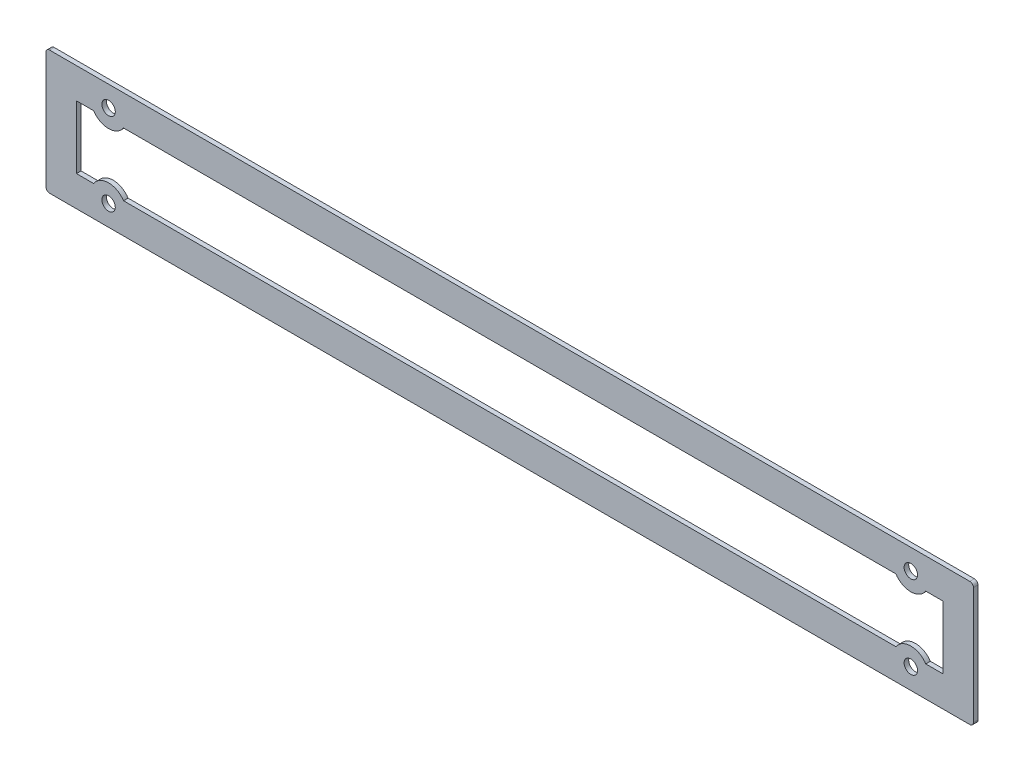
ISO-10303-21;
HEADER;
FILE_DESCRIPTION(('STEP AP214'),'2;1');
FILE_NAME('part.step','',(''),(''),'','','');
FILE_SCHEMA(('AUTOMOTIVE_DESIGN { 1 0 10303 214 1 1 1 1 }'));
ENDSEC;
DATA;
#1=APPLICATION_CONTEXT('core data for automotive mechanical design processes');
#2=APPLICATION_PROTOCOL_DEFINITION('international standard','automotive_design',2000,#1);
#3=PRODUCT_CONTEXT('',#1,'mechanical');
#4=PRODUCT('Part','Part','',(#3));
#5=PRODUCT_RELATED_PRODUCT_CATEGORY('part','',(#4));
#6=PRODUCT_DEFINITION_FORMATION('','',#4);
#7=PRODUCT_DEFINITION_CONTEXT('part definition',#1,'design');
#8=PRODUCT_DEFINITION('design','',#6,#7);
#9=PRODUCT_DEFINITION_SHAPE('','',#8);
#10=(LENGTH_UNIT() NAMED_UNIT(*) SI_UNIT(.MILLI.,.METRE.));
#11=(NAMED_UNIT(*) PLANE_ANGLE_UNIT() SI_UNIT($,.RADIAN.));
#12=(NAMED_UNIT(*) SI_UNIT($,.STERADIAN.) SOLID_ANGLE_UNIT());
#13=UNCERTAINTY_MEASURE_WITH_UNIT(LENGTH_MEASURE(1.E-05),#10,'distance_accuracy_value','');
#14=(GEOMETRIC_REPRESENTATION_CONTEXT(3) GLOBAL_UNCERTAINTY_ASSIGNED_CONTEXT((#13)) GLOBAL_UNIT_ASSIGNED_CONTEXT((#10,
#11,#12)) REPRESENTATION_CONTEXT('',''));
#15=CARTESIAN_POINT('',(0.,0.,0.));
#16=DIRECTION('',(0.,0.,1.));
#17=DIRECTION('',(1.,0.,0.));
#18=AXIS2_PLACEMENT_3D('',#15,#16,#17);
#19=CARTESIAN_POINT('',(883.209871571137,555.94395895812,0.));
#20=DIRECTION('',(0.,0.,-1.));
#21=DIRECTION('',(-1.,0.,0.));
#22=AXIS2_PLACEMENT_3D('',#19,#20,#21);
#23=CYLINDRICAL_SURFACE('',#22,2.9718);
#24=CARTESIAN_POINT('',(883.209871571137,555.94395895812,2.032));
#25=DIRECTION('',(0.,0.,1.));
#26=DIRECTION('',(-1.,0.,0.));
#27=AXIS2_PLACEMENT_3D('',#24,#25,#26);
#28=CIRCLE('',#27,2.9718);
#29=CARTESIAN_POINT('',(886.181671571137,555.94395895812,2.032));
#30=VERTEX_POINT('',#29);
#31=EDGE_CURVE('E11',#30,#30,#28,.T.);
#32=ORIENTED_EDGE('',*,*,#31,.T.);
#33=EDGE_LOOP('',(#32));
#34=FACE_BOUND('',#33,.T.);
#35=CARTESIAN_POINT('',(883.209871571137,555.94395895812,0.));
#36=DIRECTION('',(0.,0.,-1.));
#37=DIRECTION('',(-1.,0.,0.));
#38=AXIS2_PLACEMENT_3D('',#35,#36,#37);
#39=CIRCLE('',#38,2.9718);
#40=CARTESIAN_POINT('',(886.181671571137,555.94395895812,0.));
#41=VERTEX_POINT('',#40);
#42=EDGE_CURVE('E27',#41,#41,#39,.T.);
#43=ORIENTED_EDGE('',*,*,#42,.T.);
#44=EDGE_LOOP('',(#43));
#45=FACE_BOUND('',#44,.T.);
#46=ADVANCED_FACE('F16',(#34,#45),#23,.F.);
#47=CARTESIAN_POINT('',(883.209871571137,519.26635895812,0.));
#48=DIRECTION('',(0.,0.,-1.));
#49=DIRECTION('',(-1.,0.,0.));
#50=AXIS2_PLACEMENT_3D('',#47,#48,#49);
#51=CYLINDRICAL_SURFACE('',#50,2.9718);
#52=CARTESIAN_POINT('',(883.209871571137,519.26635895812,2.032));
#53=DIRECTION('',(0.,0.,1.));
#54=DIRECTION('',(-1.,0.,0.));
#55=AXIS2_PLACEMENT_3D('',#52,#53,#54);
#56=CIRCLE('',#55,2.9718);
#57=CARTESIAN_POINT('',(886.181671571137,519.26635895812,2.032));
#58=VERTEX_POINT('',#57);
#59=EDGE_CURVE('E291',#58,#58,#56,.T.);
#60=ORIENTED_EDGE('',*,*,#59,.T.);
#61=EDGE_LOOP('',(#60));
#62=FACE_BOUND('',#61,.T.);
#63=CARTESIAN_POINT('',(883.209871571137,519.26635895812,0.));
#64=DIRECTION('',(0.,0.,-1.));
#65=DIRECTION('',(-1.,0.,0.));
#66=AXIS2_PLACEMENT_3D('',#63,#64,#65);
#67=CIRCLE('',#66,2.9718);
#68=CARTESIAN_POINT('',(886.181671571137,519.26635895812,0.));
#69=VERTEX_POINT('',#68);
#70=EDGE_CURVE('E287',#69,#69,#67,.T.);
#71=ORIENTED_EDGE('',*,*,#70,.T.);
#72=EDGE_LOOP('',(#71));
#73=FACE_BOUND('',#72,.T.);
#74=ADVANCED_FACE('F521',(#62,#73),#51,.F.);
#75=CARTESIAN_POINT('',(1238.80987157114,555.94395895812,0.));
#76=DIRECTION('',(0.,0.,-1.));
#77=DIRECTION('',(-1.,0.,0.));
#78=AXIS2_PLACEMENT_3D('',#75,#76,#77);
#79=CYLINDRICAL_SURFACE('',#78,2.97180000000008);
#80=CARTESIAN_POINT('',(1238.80987157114,555.94395895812,2.032));
#81=DIRECTION('',(0.,0.,1.));
#82=DIRECTION('',(-1.,0.,0.));
#83=AXIS2_PLACEMENT_3D('',#80,#81,#82);
#84=CIRCLE('',#83,2.97180000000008);
#85=CARTESIAN_POINT('',(1241.78167157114,555.94395895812,2.032));
#86=VERTEX_POINT('',#85);
#87=EDGE_CURVE('E227',#86,#86,#84,.T.);
#88=ORIENTED_EDGE('',*,*,#87,.T.);
#89=EDGE_LOOP('',(#88));
#90=FACE_BOUND('',#89,.T.);
#91=CARTESIAN_POINT('',(1238.80987157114,555.94395895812,0.));
#92=DIRECTION('',(0.,0.,-1.));
#93=DIRECTION('',(-1.,0.,0.));
#94=AXIS2_PLACEMENT_3D('',#91,#92,#93);
#95=CIRCLE('',#94,2.97180000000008);
#96=CARTESIAN_POINT('',(1241.78167157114,555.94395895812,0.));
#97=VERTEX_POINT('',#96);
#98=EDGE_CURVE('E221',#97,#97,#95,.T.);
#99=ORIENTED_EDGE('',*,*,#98,.T.);
#100=EDGE_LOOP('',(#99));
#101=FACE_BOUND('',#100,.T.);
#102=ADVANCED_FACE('F517',(#90,#101),#79,.F.);
#103=CARTESIAN_POINT('',(1238.80987157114,519.26635895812,0.));
#104=DIRECTION('',(0.,0.,-1.));
#105=DIRECTION('',(-1.,0.,0.));
#106=AXIS2_PLACEMENT_3D('',#103,#104,#105);
#107=CYLINDRICAL_SURFACE('',#106,2.97180000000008);
#108=CARTESIAN_POINT('',(1238.80987157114,519.26635895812,2.032));
#109=DIRECTION('',(0.,0.,1.));
#110=DIRECTION('',(-1.,0.,0.));
#111=AXIS2_PLACEMENT_3D('',#108,#109,#110);
#112=CIRCLE('',#111,2.97180000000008);
#113=CARTESIAN_POINT('',(1241.78167157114,519.26635895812,2.032));
#114=VERTEX_POINT('',#113);
#115=EDGE_CURVE('E216',#114,#114,#112,.T.);
#116=ORIENTED_EDGE('',*,*,#115,.T.);
#117=EDGE_LOOP('',(#116));
#118=FACE_BOUND('',#117,.T.);
#119=CARTESIAN_POINT('',(1238.80987157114,519.26635895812,0.));
#120=DIRECTION('',(0.,0.,-1.));
#121=DIRECTION('',(-1.,0.,0.));
#122=AXIS2_PLACEMENT_3D('',#119,#120,#121);
#123=CIRCLE('',#122,2.97180000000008);
#124=CARTESIAN_POINT('',(1241.78167157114,519.26635895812,0.));
#125=VERTEX_POINT('',#124);
#126=EDGE_CURVE('E222',#125,#125,#123,.T.);
#127=ORIENTED_EDGE('',*,*,#126,.T.);
#128=EDGE_LOOP('',(#127));
#129=FACE_BOUND('',#128,.T.);
#130=ADVANCED_FACE('F509',(#118,#129),#107,.F.);
#131=CARTESIAN_POINT('',(1061.00987157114,523.63515895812,0.));
#132=DIRECTION('',(0.,1.,0.));
#133=DIRECTION('',(-1.,0.,0.));
#134=AXIS2_PLACEMENT_3D('',#131,#132,#133);
#135=PLANE('',#134);
#136=DIRECTION('',(1.,0.,0.));
#137=VECTOR('',#136,1.);
#138=CARTESIAN_POINT('',(1232.18284412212,523.63515895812,2.032));
#139=LINE('',#138,#137);
#140=CARTESIAN_POINT('',(889.836899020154,523.63515895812,2.032));
#141=VERTEX_POINT('',#140);
#142=CARTESIAN_POINT('',(1232.18284412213,523.635158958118,2.032));
#143=VERTEX_POINT('',#142);
#144=EDGE_CURVE('E230',#141,#143,#139,.T.);
#145=ORIENTED_EDGE('',*,*,#144,.T.);
#146=DIRECTION('',(0.,0.,1.));
#147=VECTOR('',#146,1.);
#148=CARTESIAN_POINT('',(1232.18284412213,523.635158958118,0.));
#149=LINE('',#148,#147);
#150=CARTESIAN_POINT('',(1232.18284412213,523.635158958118,0.));
#151=VERTEX_POINT('',#150);
#152=EDGE_CURVE('E309',#151,#143,#149,.T.);
#153=ORIENTED_EDGE('',*,*,#152,.F.);
#154=DIRECTION('',(-1.,0.,0.));
#155=VECTOR('',#154,1.);
#156=CARTESIAN_POINT('',(1232.18284412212,523.63515895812,0.));
#157=LINE('',#156,#155);
#158=CARTESIAN_POINT('',(889.836899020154,523.63515895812,0.));
#159=VERTEX_POINT('',#158);
#160=EDGE_CURVE('E255',#151,#159,#157,.T.);
#161=ORIENTED_EDGE('',*,*,#160,.T.);
#162=DIRECTION('',(0.,0.,1.));
#163=VECTOR('',#162,1.);
#164=CARTESIAN_POINT('',(889.836899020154,523.63515895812,0.));
#165=LINE('',#164,#163);
#166=EDGE_CURVE('E253',#159,#141,#165,.T.);
#167=ORIENTED_EDGE('',*,*,#166,.T.);
#168=EDGE_LOOP('',(#145,#153,#161,#167));
#169=FACE_BOUND('',#168,.T.);
#170=ADVANCED_FACE('F507',(#169),#135,.T.);
#171=CARTESIAN_POINT('',(1238.80987157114,519.266358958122,0.));
#172=DIRECTION('',(0.,0.,-1.));
#173=DIRECTION('',(1.,0.,0.));
#174=AXIS2_PLACEMENT_3D('',#171,#172,#173);
#175=CYLINDRICAL_SURFACE('',#174,7.93750000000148);
#176=CARTESIAN_POINT('',(1238.80987157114,519.266358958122,2.032));
#177=DIRECTION('',(0.,0.,-1.));
#178=DIRECTION('',(1.,0.,0.));
#179=AXIS2_PLACEMENT_3D('',#176,#177,#178);
#180=CIRCLE('',#179,7.93750000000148);
#181=CARTESIAN_POINT('',(1245.43689902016,523.63515895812,2.032));
#182=VERTEX_POINT('',#181);
#183=EDGE_CURVE('E256',#143,#182,#180,.T.);
#184=ORIENTED_EDGE('',*,*,#183,.T.);
#185=DIRECTION('',(0.,0.,1.));
#186=VECTOR('',#185,1.);
#187=CARTESIAN_POINT('',(1245.43689902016,523.63515895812,0.));
#188=LINE('',#187,#186);
#189=CARTESIAN_POINT('',(1245.43689902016,523.63515895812,0.));
#190=VERTEX_POINT('',#189);
#191=EDGE_CURVE('E361',#190,#182,#188,.T.);
#192=ORIENTED_EDGE('',*,*,#191,.F.);
#193=CARTESIAN_POINT('',(1238.80987157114,519.266358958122,0.));
#194=DIRECTION('',(0.,0.,1.));
#195=DIRECTION('',(1.,0.,0.));
#196=AXIS2_PLACEMENT_3D('',#193,#194,#195);
#197=CIRCLE('',#196,7.93750000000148);
#198=EDGE_CURVE('E312',#190,#151,#197,.T.);
#199=ORIENTED_EDGE('',*,*,#198,.T.);
#200=ORIENTED_EDGE('',*,*,#152,.T.);
#201=EDGE_LOOP('',(#184,#192,#199,#200));
#202=FACE_BOUND('',#201,.T.);
#203=ADVANCED_FACE('F495',(#202),#175,.T.);
#204=CARTESIAN_POINT('',(1249.23538529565,523.63515895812,0.));
#205=DIRECTION('',(0.,1.,0.));
#206=DIRECTION('',(-1.,0.,0.));
#207=AXIS2_PLACEMENT_3D('',#204,#205,#206);
#208=PLANE('',#207);
#209=DIRECTION('',(1.,0.,0.));
#210=VECTOR('',#209,1.);
#211=CARTESIAN_POINT('',(1253.03387157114,523.63515895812,2.032));
#212=LINE('',#211,#210);
#213=CARTESIAN_POINT('',(1253.03387157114,523.63515895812,2.032));
#214=VERTEX_POINT('',#213);
#215=EDGE_CURVE('E313',#182,#214,#212,.T.);
#216=ORIENTED_EDGE('',*,*,#215,.T.);
#217=DIRECTION('',(0.,0.,1.));
#218=VECTOR('',#217,1.);
#219=CARTESIAN_POINT('',(1253.03387157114,523.63515895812,0.));
#220=LINE('',#219,#218);
#221=CARTESIAN_POINT('',(1253.03387157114,523.63515895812,0.));
#222=VERTEX_POINT('',#221);
#223=EDGE_CURVE('E300',#222,#214,#220,.T.);
#224=ORIENTED_EDGE('',*,*,#223,.F.);
#225=DIRECTION('',(-1.,0.,0.));
#226=VECTOR('',#225,1.);
#227=CARTESIAN_POINT('',(1253.03387157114,523.63515895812,0.));
#228=LINE('',#227,#226);
#229=EDGE_CURVE('E357',#222,#190,#228,.T.);
#230=ORIENTED_EDGE('',*,*,#229,.T.);
#231=ORIENTED_EDGE('',*,*,#191,.T.);
#232=EDGE_LOOP('',(#216,#224,#230,#231));
#233=FACE_BOUND('',#232,.T.);
#234=ADVANCED_FACE('F500',(#233),#208,.T.);
#235=CARTESIAN_POINT('',(1253.03387157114,537.60515895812,0.));
#236=DIRECTION('',(-1.,0.,0.));
#237=DIRECTION('',(0.,-1.,0.));
#238=AXIS2_PLACEMENT_3D('',#235,#236,#237);
#239=PLANE('',#238);
#240=DIRECTION('',(0.,1.,0.));
#241=VECTOR('',#240,1.);
#242=CARTESIAN_POINT('',(1253.03387157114,551.57515895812,2.032));
#243=LINE('',#242,#241);
#244=CARTESIAN_POINT('',(1253.03387157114,551.57515895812,2.032));
#245=VERTEX_POINT('',#244);
#246=EDGE_CURVE('E299',#214,#245,#243,.T.);
#247=ORIENTED_EDGE('',*,*,#246,.T.);
#248=DIRECTION('',(0.,0.,1.));
#249=VECTOR('',#248,1.);
#250=CARTESIAN_POINT('',(1253.03387157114,551.57515895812,0.));
#251=LINE('',#250,#249);
#252=CARTESIAN_POINT('',(1253.03387157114,551.57515895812,0.));
#253=VERTEX_POINT('',#252);
#254=EDGE_CURVE('E343',#253,#245,#251,.T.);
#255=ORIENTED_EDGE('',*,*,#254,.F.);
#256=DIRECTION('',(0.,-1.,0.));
#257=VECTOR('',#256,1.);
#258=CARTESIAN_POINT('',(1253.03387157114,551.57515895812,0.));
#259=LINE('',#258,#257);
#260=EDGE_CURVE('E295',#253,#222,#259,.T.);
#261=ORIENTED_EDGE('',*,*,#260,.T.);
#262=ORIENTED_EDGE('',*,*,#223,.T.);
#263=EDGE_LOOP('',(#247,#255,#261,#262));
#264=FACE_BOUND('',#263,.T.);
#265=ADVANCED_FACE('F503',(#264),#239,.T.);
#266=CARTESIAN_POINT('',(1249.23538529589,551.57515895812,0.));
#267=DIRECTION('',(0.,-1.,0.));
#268=DIRECTION('',(1.,0.,0.));
#269=AXIS2_PLACEMENT_3D('',#266,#267,#268);
#270=PLANE('',#269);
#271=DIRECTION('',(-1.,0.,0.));
#272=VECTOR('',#271,1.);
#273=CARTESIAN_POINT('',(1245.43689902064,551.57515895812,2.032));
#274=LINE('',#273,#272);
#275=CARTESIAN_POINT('',(1245.43689902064,551.57515895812,2.032));
#276=VERTEX_POINT('',#275);
#277=EDGE_CURVE('E308',#245,#276,#274,.T.);
#278=ORIENTED_EDGE('',*,*,#277,.T.);
#279=DIRECTION('',(0.,0.,1.));
#280=VECTOR('',#279,1.);
#281=CARTESIAN_POINT('',(1245.43689902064,551.57515895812,0.));
#282=LINE('',#281,#280);
#283=CARTESIAN_POINT('',(1245.43689902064,551.57515895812,0.));
#284=VERTEX_POINT('',#283);
#285=EDGE_CURVE('E331',#284,#276,#282,.T.);
#286=ORIENTED_EDGE('',*,*,#285,.F.);
#287=DIRECTION('',(1.,0.,0.));
#288=VECTOR('',#287,1.);
#289=CARTESIAN_POINT('',(1245.43689902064,551.57515895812,0.));
#290=LINE('',#289,#288);
#291=EDGE_CURVE('E339',#284,#253,#290,.T.);
#292=ORIENTED_EDGE('',*,*,#291,.T.);
#293=ORIENTED_EDGE('',*,*,#254,.T.);
#294=EDGE_LOOP('',(#278,#286,#292,#293));
#295=FACE_BOUND('',#294,.T.);
#296=ADVANCED_FACE('F420',(#295),#270,.T.);
#297=CARTESIAN_POINT('',(1238.80987157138,555.943958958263,0.));
#298=DIRECTION('',(0.,0.,-1.));
#299=DIRECTION('',(1.,0.,0.));
#300=AXIS2_PLACEMENT_3D('',#297,#298,#299);
#301=CYLINDRICAL_SURFACE('',#300,7.93750000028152);
#302=CARTESIAN_POINT('',(1238.80987157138,555.943958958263,2.032));
#303=DIRECTION('',(0.,0.,-1.));
#304=DIRECTION('',(1.,0.,0.));
#305=AXIS2_PLACEMENT_3D('',#302,#303,#304);
#306=CIRCLE('',#305,7.93750000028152);
#307=CARTESIAN_POINT('',(1232.18284412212,551.575158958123,2.032));
#308=VERTEX_POINT('',#307);
#309=EDGE_CURVE('E376',#276,#308,#306,.T.);
#310=ORIENTED_EDGE('',*,*,#309,.T.);
#311=DIRECTION('',(0.,0.,1.));
#312=VECTOR('',#311,1.);
#313=CARTESIAN_POINT('',(1232.18284412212,551.575158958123,0.));
#314=LINE('',#313,#312);
#315=CARTESIAN_POINT('',(1232.18284412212,551.575158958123,0.));
#316=VERTEX_POINT('',#315);
#317=EDGE_CURVE('E20',#316,#308,#314,.T.);
#318=ORIENTED_EDGE('',*,*,#317,.F.);
#319=CARTESIAN_POINT('',(1238.80987157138,555.943958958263,0.));
#320=DIRECTION('',(0.,0.,1.));
#321=DIRECTION('',(1.,0.,0.));
#322=AXIS2_PLACEMENT_3D('',#319,#320,#321);
#323=CIRCLE('',#322,7.93750000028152);
#324=EDGE_CURVE('E396',#316,#284,#323,.T.);
#325=ORIENTED_EDGE('',*,*,#324,.T.);
#326=ORIENTED_EDGE('',*,*,#285,.T.);
#327=EDGE_LOOP('',(#310,#318,#325,#326));
#328=FACE_BOUND('',#327,.T.);
#329=ADVANCED_FACE('F413',(#328),#301,.T.);
#330=CARTESIAN_POINT('',(1061.00987157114,551.575158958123,0.));
#331=DIRECTION('',(0.,-1.,0.));
#332=DIRECTION('',(1.,0.,0.));
#333=AXIS2_PLACEMENT_3D('',#330,#331,#332);
#334=PLANE('',#333);
#335=DIRECTION('',(-1.,0.,0.));
#336=VECTOR('',#335,1.);
#337=CARTESIAN_POINT('',(889.836899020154,551.575158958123,2.032));
#338=LINE('',#337,#336);
#339=CARTESIAN_POINT('',(889.836899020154,551.575158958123,2.032));
#340=VERTEX_POINT('',#339);
#341=EDGE_CURVE('E327',#308,#340,#338,.T.);
#342=ORIENTED_EDGE('',*,*,#341,.T.);
#343=DIRECTION('',(0.,0.,1.));
#344=VECTOR('',#343,1.);
#345=CARTESIAN_POINT('',(889.836899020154,551.575158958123,0.));
#346=LINE('',#345,#344);
#347=CARTESIAN_POINT('',(889.836899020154,551.575158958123,0.));
#348=VERTEX_POINT('',#347);
#349=EDGE_CURVE('E258',#348,#340,#346,.T.);
#350=ORIENTED_EDGE('',*,*,#349,.F.);
#351=DIRECTION('',(1.,0.,0.));
#352=VECTOR('',#351,1.);
#353=CARTESIAN_POINT('',(889.836899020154,551.575158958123,0.));
#354=LINE('',#353,#352);
#355=EDGE_CURVE('E332',#348,#316,#354,.T.);
#356=ORIENTED_EDGE('',*,*,#355,.T.);
#357=ORIENTED_EDGE('',*,*,#317,.T.);
#358=EDGE_LOOP('',(#342,#350,#356,#357));
#359=FACE_BOUND('',#358,.T.);
#360=ADVANCED_FACE('F429',(#359),#334,.T.);
#361=CARTESIAN_POINT('',(883.209871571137,555.943958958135,0.));
#362=DIRECTION('',(0.,0.,-1.));
#363=DIRECTION('',(1.,0.,0.));
#364=AXIS2_PLACEMENT_3D('',#361,#362,#363);
#365=CYLINDRICAL_SURFACE('',#364,7.93750000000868);
#366=CARTESIAN_POINT('',(883.209871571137,555.943958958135,2.032));
#367=DIRECTION('',(0.,0.,-1.));
#368=DIRECTION('',(1.,0.,0.));
#369=AXIS2_PLACEMENT_3D('',#366,#367,#368);
#370=CIRCLE('',#369,7.93750000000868);
#371=CARTESIAN_POINT('',(876.58284412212,551.575158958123,2.032));
#372=VERTEX_POINT('',#371);
#373=EDGE_CURVE('E266',#340,#372,#370,.T.);
#374=ORIENTED_EDGE('',*,*,#373,.T.);
#375=DIRECTION('',(0.,0.,1.));
#376=VECTOR('',#375,1.);
#377=CARTESIAN_POINT('',(876.58284412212,551.575158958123,0.));
#378=LINE('',#377,#376);
#379=CARTESIAN_POINT('',(876.58284412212,551.575158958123,0.));
#380=VERTEX_POINT('',#379);
#381=EDGE_CURVE('E234',#380,#372,#378,.T.);
#382=ORIENTED_EDGE('',*,*,#381,.F.);
#383=CARTESIAN_POINT('',(883.209871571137,555.943958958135,0.));
#384=DIRECTION('',(0.,0.,1.));
#385=DIRECTION('',(1.,0.,0.));
#386=AXIS2_PLACEMENT_3D('',#383,#384,#385);
#387=CIRCLE('',#386,7.93750000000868);
#388=EDGE_CURVE('E261',#380,#348,#387,.T.);
#389=ORIENTED_EDGE('',*,*,#388,.T.);
#390=ORIENTED_EDGE('',*,*,#349,.T.);
#391=EDGE_LOOP('',(#374,#382,#389,#390));
#392=FACE_BOUND('',#391,.T.);
#393=ADVANCED_FACE('F536',(#392),#365,.T.);
#394=CARTESIAN_POINT('',(872.784357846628,551.575158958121,0.));
#395=DIRECTION('',(3.35537880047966E-13,-1.,0.));
#396=DIRECTION('',(1.,3.35537880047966E-13,0.));
#397=AXIS2_PLACEMENT_3D('',#394,#395,#396);
#398=PLANE('',#397);
#399=DIRECTION('',(-1.,-3.35537880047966E-13,0.));
#400=VECTOR('',#399,1.);
#401=CARTESIAN_POINT('',(868.985871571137,551.57515895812,2.032));
#402=LINE('',#401,#400);
#403=CARTESIAN_POINT('',(868.985871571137,551.57515895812,2.032));
#404=VERTEX_POINT('',#403);
#405=EDGE_CURVE('E262',#372,#404,#402,.T.);
#406=ORIENTED_EDGE('',*,*,#405,.T.);
#407=DIRECTION('',(0.,0.,1.));
#408=VECTOR('',#407,1.);
#409=CARTESIAN_POINT('',(868.985871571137,551.57515895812,0.));
#410=LINE('',#409,#408);
#411=CARTESIAN_POINT('',(868.985871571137,551.57515895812,0.));
#412=VERTEX_POINT('',#411);
#413=EDGE_CURVE('E462',#412,#404,#410,.T.);
#414=ORIENTED_EDGE('',*,*,#413,.F.);
#415=DIRECTION('',(1.,3.35537880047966E-13,0.));
#416=VECTOR('',#415,1.);
#417=CARTESIAN_POINT('',(868.985871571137,551.57515895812,0.));
#418=LINE('',#417,#416);
#419=EDGE_CURVE('E326',#412,#380,#418,.T.);
#420=ORIENTED_EDGE('',*,*,#419,.T.);
#421=ORIENTED_EDGE('',*,*,#381,.T.);
#422=EDGE_LOOP('',(#406,#414,#420,#421));
#423=FACE_BOUND('',#422,.T.);
#424=ADVANCED_FACE('F539',(#423),#398,.T.);
#425=CARTESIAN_POINT('',(868.985871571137,537.60515895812,0.));
#426=DIRECTION('',(1.,0.,0.));
#427=DIRECTION('',(0.,1.,0.));
#428=AXIS2_PLACEMENT_3D('',#425,#426,#427);
#429=PLANE('',#428);
#430=DIRECTION('',(0.,-1.,0.));
#431=VECTOR('',#430,1.);
#432=CARTESIAN_POINT('',(868.985871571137,523.63515895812,2.032));
#433=LINE('',#432,#431);
#434=CARTESIAN_POINT('',(868.985871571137,523.63515895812,2.032));
#435=VERTEX_POINT('',#434);
#436=EDGE_CURVE('E236',#404,#435,#433,.T.);
#437=ORIENTED_EDGE('',*,*,#436,.T.);
#438=DIRECTION('',(0.,0.,1.));
#439=VECTOR('',#438,1.);
#440=CARTESIAN_POINT('',(868.985871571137,523.63515895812,0.));
#441=LINE('',#440,#439);
#442=CARTESIAN_POINT('',(868.985871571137,523.63515895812,0.));
#443=VERTEX_POINT('',#442);
#444=EDGE_CURVE('E337',#443,#435,#441,.T.);
#445=ORIENTED_EDGE('',*,*,#444,.F.);
#446=DIRECTION('',(0.,1.,0.));
#447=VECTOR('',#446,1.);
#448=CARTESIAN_POINT('',(868.985871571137,523.63515895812,0.));
#449=LINE('',#448,#447);
#450=EDGE_CURVE('E240',#443,#412,#449,.T.);
#451=ORIENTED_EDGE('',*,*,#450,.T.);
#452=ORIENTED_EDGE('',*,*,#413,.T.);
#453=EDGE_LOOP('',(#437,#445,#451,#452));
#454=FACE_BOUND('',#453,.T.);
#455=ADVANCED_FACE('F474',(#454),#429,.T.);
#456=CARTESIAN_POINT('',(872.78435784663,523.63515895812,0.));
#457=DIRECTION('',(0.,1.,0.));
#458=DIRECTION('',(-1.,0.,0.));
#459=AXIS2_PLACEMENT_3D('',#456,#457,#458);
#460=PLANE('',#459);
#461=DIRECTION('',(1.,0.,0.));
#462=VECTOR('',#461,1.);
#463=CARTESIAN_POINT('',(876.582844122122,523.63515895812,2.032));
#464=LINE('',#463,#462);
#465=CARTESIAN_POINT('',(876.582844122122,523.635158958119,2.032));
#466=VERTEX_POINT('',#465);
#467=EDGE_CURVE('E410',#435,#466,#464,.T.);
#468=ORIENTED_EDGE('',*,*,#467,.T.);
#469=DIRECTION('',(0.,0.,1.));
#470=VECTOR('',#469,1.);
#471=CARTESIAN_POINT('',(876.582844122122,523.635158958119,0.));
#472=LINE('',#471,#470);
#473=CARTESIAN_POINT('',(876.582844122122,523.635158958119,0.));
#474=VERTEX_POINT('',#473);
#475=EDGE_CURVE('E351',#474,#466,#472,.T.);
#476=ORIENTED_EDGE('',*,*,#475,.F.);
#477=DIRECTION('',(-1.,0.,0.));
#478=VECTOR('',#477,1.);
#479=CARTESIAN_POINT('',(876.582844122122,523.63515895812,0.));
#480=LINE('',#479,#478);
#481=EDGE_CURVE('E407',#474,#443,#480,.T.);
#482=ORIENTED_EDGE('',*,*,#481,.T.);
#483=ORIENTED_EDGE('',*,*,#444,.T.);
#484=EDGE_LOOP('',(#468,#476,#482,#483));
#485=FACE_BOUND('',#484,.T.);
#486=ADVANCED_FACE('F483',(#485),#460,.T.);
#487=CARTESIAN_POINT('',(883.209871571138,519.266358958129,0.));
#488=DIRECTION('',(0.,0.,-1.));
#489=DIRECTION('',(1.,0.,0.));
#490=AXIS2_PLACEMENT_3D('',#487,#488,#489);
#491=CYLINDRICAL_SURFACE('',#490,7.93749999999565);
#492=CARTESIAN_POINT('',(883.209871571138,519.266358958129,2.032));
#493=DIRECTION('',(0.,0.,-1.));
#494=DIRECTION('',(1.,0.,0.));
#495=AXIS2_PLACEMENT_3D('',#492,#493,#494);
#496=CIRCLE('',#495,7.93749999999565);
#497=EDGE_CURVE('E333',#466,#141,#496,.T.);
#498=ORIENTED_EDGE('',*,*,#497,.T.);
#499=ORIENTED_EDGE('',*,*,#166,.F.);
#500=CARTESIAN_POINT('',(883.209871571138,519.266358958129,0.));
#501=DIRECTION('',(0.,0.,1.));
#502=DIRECTION('',(1.,0.,0.));
#503=AXIS2_PLACEMENT_3D('',#500,#501,#502);
#504=CIRCLE('',#503,7.93749999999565);
#505=EDGE_CURVE('E338',#159,#474,#504,.T.);
#506=ORIENTED_EDGE('',*,*,#505,.T.);
#507=ORIENTED_EDGE('',*,*,#475,.T.);
#508=EDGE_LOOP('',(#498,#499,#506,#507));
#509=FACE_BOUND('',#508,.T.);
#510=ADVANCED_FACE('F487',(#509),#491,.T.);
#511=CARTESIAN_POINT('',(1266.54667157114,537.60515895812,0.));
#512=DIRECTION('',(1.,0.,0.));
#513=DIRECTION('',(0.,1.,0.));
#514=AXIS2_PLACEMENT_3D('',#511,#512,#513);
#515=PLANE('',#514);
#516=DIRECTION('',(0.,-1.,0.));
#517=VECTOR('',#516,1.);
#518=CARTESIAN_POINT('',(1266.54667157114,511.69715895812,2.032));
#519=LINE('',#518,#517);
#520=CARTESIAN_POINT('',(1266.54667157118,563.51315895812,2.032));
#521=VERTEX_POINT('',#520);
#522=CARTESIAN_POINT('',(1266.54667157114,511.69715895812,2.032));
#523=VERTEX_POINT('',#522);
#524=EDGE_CURVE('E305',#521,#523,#519,.T.);
#525=ORIENTED_EDGE('',*,*,#524,.T.);
#526=DIRECTION('',(0.,0.,1.));
#527=VECTOR('',#526,1.);
#528=CARTESIAN_POINT('',(1266.54667157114,511.69715895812,0.));
#529=LINE('',#528,#527);
#530=CARTESIAN_POINT('',(1266.54667157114,511.69715895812,0.));
#531=VERTEX_POINT('',#530);
#532=EDGE_CURVE('E317',#531,#523,#529,.T.);
#533=ORIENTED_EDGE('',*,*,#532,.F.);
#534=DIRECTION('',(0.,1.,0.));
#535=VECTOR('',#534,1.);
#536=CARTESIAN_POINT('',(1266.54667157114,511.69715895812,0.));
#537=LINE('',#536,#535);
#538=CARTESIAN_POINT('',(1266.54667157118,563.51315895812,0.));
#539=VERTEX_POINT('',#538);
#540=EDGE_CURVE('E301',#531,#539,#537,.T.);
#541=ORIENTED_EDGE('',*,*,#540,.T.);
#542=DIRECTION('',(0.,0.,1.));
#543=VECTOR('',#542,1.);
#544=CARTESIAN_POINT('',(1266.54667157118,563.51315895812,0.));
#545=LINE('',#544,#543);
#546=EDGE_CURVE('E251',#539,#521,#545,.T.);
#547=ORIENTED_EDGE('',*,*,#546,.T.);
#548=EDGE_LOOP('',(#525,#533,#541,#547));
#549=FACE_BOUND('',#548,.T.);
#550=ADVANCED_FACE('F546',(#549),#515,.T.);
#551=CARTESIAN_POINT('',(1264.97187157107,511.697158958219,0.));
#552=DIRECTION('',(0.,0.,-1.));
#553=DIRECTION('',(1.,0.,0.));
#554=AXIS2_PLACEMENT_3D('',#551,#552,#553);
#555=CYLINDRICAL_SURFACE('',#554,1.57480000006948);
#556=CARTESIAN_POINT('',(1264.97187157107,511.697158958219,2.032));
#557=DIRECTION('',(0.,0.,-1.));
#558=DIRECTION('',(1.,0.,0.));
#559=AXIS2_PLACEMENT_3D('',#556,#557,#558);
#560=CIRCLE('',#559,1.57480000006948);
#561=CARTESIAN_POINT('',(1264.97187157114,510.12235895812,2.032));
#562=VERTEX_POINT('',#561);
#563=EDGE_CURVE('E247',#523,#562,#560,.T.);
#564=ORIENTED_EDGE('',*,*,#563,.T.);
#565=DIRECTION('',(0.,0.,1.));
#566=VECTOR('',#565,1.);
#567=CARTESIAN_POINT('',(1264.97187157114,510.12235895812,0.));
#568=LINE('',#567,#566);
#569=CARTESIAN_POINT('',(1264.97187157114,510.12235895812,0.));
#570=VERTEX_POINT('',#569);
#571=EDGE_CURVE('E267',#570,#562,#568,.T.);
#572=ORIENTED_EDGE('',*,*,#571,.F.);
#573=CARTESIAN_POINT('',(1264.97187157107,511.697158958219,0.));
#574=DIRECTION('',(0.,0.,1.));
#575=DIRECTION('',(1.,0.,0.));
#576=AXIS2_PLACEMENT_3D('',#573,#574,#575);
#577=CIRCLE('',#576,1.57480000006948);
#578=EDGE_CURVE('E252',#570,#531,#577,.T.);
#579=ORIENTED_EDGE('',*,*,#578,.T.);
#580=ORIENTED_EDGE('',*,*,#532,.T.);
#581=EDGE_LOOP('',(#564,#572,#579,#580));
#582=FACE_BOUND('',#581,.T.);
#583=ADVANCED_FACE('F542',(#582),#555,.T.);
#584=CARTESIAN_POINT('',(1061.00987157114,510.12235895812,0.));
#585=DIRECTION('',(0.,-1.,0.));
#586=DIRECTION('',(1.,0.,0.));
#587=AXIS2_PLACEMENT_3D('',#584,#585,#586);
#588=PLANE('',#587);
#589=DIRECTION('',(-1.,0.,0.));
#590=VECTOR('',#589,1.);
#591=CARTESIAN_POINT('',(857.047871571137,510.12235895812,2.032));
#592=LINE('',#591,#590);
#593=CARTESIAN_POINT('',(857.047871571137,510.12235895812,2.032));
#594=VERTEX_POINT('',#593);
#595=EDGE_CURVE('E382',#562,#594,#592,.T.);
#596=ORIENTED_EDGE('',*,*,#595,.T.);
#597=DIRECTION('',(0.,0.,1.));
#598=VECTOR('',#597,1.);
#599=CARTESIAN_POINT('',(857.047871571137,510.12235895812,0.));
#600=LINE('',#599,#598);
#601=CARTESIAN_POINT('',(857.047871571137,510.12235895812,0.));
#602=VERTEX_POINT('',#601);
#603=EDGE_CURVE('E322',#602,#594,#600,.T.);
#604=ORIENTED_EDGE('',*,*,#603,.F.);
#605=DIRECTION('',(1.,0.,0.));
#606=VECTOR('',#605,1.);
#607=CARTESIAN_POINT('',(857.047871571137,510.12235895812,0.));
#608=LINE('',#607,#606);
#609=EDGE_CURVE('E270',#602,#570,#608,.T.);
#610=ORIENTED_EDGE('',*,*,#609,.T.);
#611=ORIENTED_EDGE('',*,*,#571,.T.);
#612=EDGE_LOOP('',(#596,#604,#610,#611));
#613=FACE_BOUND('',#612,.T.);
#614=ADVANCED_FACE('F545',(#613),#588,.T.);
#615=CARTESIAN_POINT('',(857.047871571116,511.69715895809,0.));
#616=DIRECTION('',(0.,0.,-1.));
#617=DIRECTION('',(1.,0.,0.));
#618=AXIS2_PLACEMENT_3D('',#615,#616,#617);
#619=CYLINDRICAL_SURFACE('',#618,1.5747999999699);
#620=CARTESIAN_POINT('',(857.047871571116,511.69715895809,2.032));
#621=DIRECTION('',(0.,0.,-1.));
#622=DIRECTION('',(1.,0.,0.));
#623=AXIS2_PLACEMENT_3D('',#620,#621,#622);
#624=CIRCLE('',#623,1.5747999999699);
#625=CARTESIAN_POINT('',(855.473071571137,511.69715895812,2.032));
#626=VERTEX_POINT('',#625);
#627=EDGE_CURVE('E271',#594,#626,#624,.T.);
#628=ORIENTED_EDGE('',*,*,#627,.T.);
#629=DIRECTION('',(0.,0.,1.));
#630=VECTOR('',#629,1.);
#631=CARTESIAN_POINT('',(855.473071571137,511.69715895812,0.));
#632=LINE('',#631,#630);
#633=CARTESIAN_POINT('',(855.473071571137,511.69715895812,0.));
#634=VERTEX_POINT('',#633);
#635=EDGE_CURVE('E362',#634,#626,#632,.T.);
#636=ORIENTED_EDGE('',*,*,#635,.F.);
#637=CARTESIAN_POINT('',(857.047871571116,511.69715895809,0.));
#638=DIRECTION('',(0.,0.,1.));
#639=DIRECTION('',(1.,0.,0.));
#640=AXIS2_PLACEMENT_3D('',#637,#638,#639);
#641=CIRCLE('',#640,1.5747999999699);
#642=EDGE_CURVE('E318',#634,#602,#641,.T.);
#643=ORIENTED_EDGE('',*,*,#642,.T.);
#644=ORIENTED_EDGE('',*,*,#603,.T.);
#645=EDGE_LOOP('',(#628,#636,#643,#644));
#646=FACE_BOUND('',#645,.T.);
#647=ADVANCED_FACE('F18',(#646),#619,.T.);
#648=CARTESIAN_POINT('',(855.473071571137,537.60515895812,0.));
#649=DIRECTION('',(-1.,0.,0.));
#650=DIRECTION('',(0.,-1.,0.));
#651=AXIS2_PLACEMENT_3D('',#648,#649,#650);
#652=PLANE('',#651);
#653=DIRECTION('',(0.,1.,0.));
#654=VECTOR('',#653,1.);
#655=CARTESIAN_POINT('',(855.473071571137,563.51315895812,2.032));
#656=LINE('',#655,#654);
#657=CARTESIAN_POINT('',(855.473071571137,563.51315895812,2.032));
#658=VERTEX_POINT('',#657);
#659=EDGE_CURVE('E386',#626,#658,#656,.T.);
#660=ORIENTED_EDGE('',*,*,#659,.T.);
#661=DIRECTION('',(0.,0.,1.));
#662=VECTOR('',#661,1.);
#663=CARTESIAN_POINT('',(855.473071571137,563.51315895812,0.));
#664=LINE('',#663,#662);
#665=CARTESIAN_POINT('',(855.473071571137,563.51315895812,0.));
#666=VERTEX_POINT('',#665);
#667=EDGE_CURVE('E277',#666,#658,#664,.T.);
#668=ORIENTED_EDGE('',*,*,#667,.F.);
#669=DIRECTION('',(0.,-1.,0.));
#670=VECTOR('',#669,1.);
#671=CARTESIAN_POINT('',(855.473071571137,563.51315895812,0.));
#672=LINE('',#671,#670);
#673=EDGE_CURVE('E365',#666,#634,#672,.T.);
#674=ORIENTED_EDGE('',*,*,#673,.T.);
#675=ORIENTED_EDGE('',*,*,#635,.T.);
#676=EDGE_LOOP('',(#660,#668,#674,#675));
#677=FACE_BOUND('',#676,.T.);
#678=ADVANCED_FACE('F573',(#677),#652,.T.);
#679=CARTESIAN_POINT('',(857.047871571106,563.513158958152,0.));
#680=DIRECTION('',(0.,0.,-1.));
#681=DIRECTION('',(1.,0.,0.));
#682=AXIS2_PLACEMENT_3D('',#679,#680,#681);
#683=CYLINDRICAL_SURFACE('',#682,1.57479999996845);
#684=CARTESIAN_POINT('',(857.047871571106,563.513158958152,2.032));
#685=DIRECTION('',(0.,0.,-1.));
#686=DIRECTION('',(1.,0.,0.));
#687=AXIS2_PLACEMENT_3D('',#684,#685,#686);
#688=CIRCLE('',#687,1.57479999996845);
#689=CARTESIAN_POINT('',(857.047871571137,565.08795895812,2.032));
#690=VERTEX_POINT('',#689);
#691=EDGE_CURVE('E276',#658,#690,#688,.T.);
#692=ORIENTED_EDGE('',*,*,#691,.T.);
#693=DIRECTION('',(0.,0.,1.));
#694=VECTOR('',#693,1.);
#695=CARTESIAN_POINT('',(857.047871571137,565.08795895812,0.));
#696=LINE('',#695,#694);
#697=CARTESIAN_POINT('',(857.047871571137,565.08795895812,0.));
#698=VERTEX_POINT('',#697);
#699=EDGE_CURVE('E283',#698,#690,#696,.T.);
#700=ORIENTED_EDGE('',*,*,#699,.F.);
#701=CARTESIAN_POINT('',(857.047871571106,563.513158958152,0.));
#702=DIRECTION('',(0.,0.,1.));
#703=DIRECTION('',(1.,0.,0.));
#704=AXIS2_PLACEMENT_3D('',#701,#702,#703);
#705=CIRCLE('',#704,1.57479999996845);
#706=EDGE_CURVE('E272',#698,#666,#705,.T.);
#707=ORIENTED_EDGE('',*,*,#706,.T.);
#708=ORIENTED_EDGE('',*,*,#667,.T.);
#709=EDGE_LOOP('',(#692,#700,#707,#708));
#710=FACE_BOUND('',#709,.T.);
#711=ADVANCED_FACE('F532',(#710),#683,.T.);
#712=CARTESIAN_POINT('',(1061.00987157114,565.08795895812,0.));
#713=DIRECTION('',(0.,1.,0.));
#714=DIRECTION('',(-1.,0.,0.));
#715=AXIS2_PLACEMENT_3D('',#712,#713,#714);
#716=PLANE('',#715);
#717=DIRECTION('',(1.,0.,0.));
#718=VECTOR('',#717,1.);
#719=CARTESIAN_POINT('',(1264.97187157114,565.08795895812,2.032));
#720=LINE('',#719,#718);
#721=CARTESIAN_POINT('',(1264.97187157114,565.08795895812,2.032));
#722=VERTEX_POINT('',#721);
#723=EDGE_CURVE('E282',#690,#722,#720,.T.);
#724=ORIENTED_EDGE('',*,*,#723,.T.);
#725=DIRECTION('',(0.,0.,1.));
#726=VECTOR('',#725,1.);
#727=CARTESIAN_POINT('',(1264.97187157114,565.08795895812,0.));
#728=LINE('',#727,#726);
#729=CARTESIAN_POINT('',(1264.97187157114,565.08795895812,0.));
#730=VERTEX_POINT('',#729);
#731=EDGE_CURVE('E246',#730,#722,#728,.T.);
#732=ORIENTED_EDGE('',*,*,#731,.F.);
#733=DIRECTION('',(-1.,0.,0.));
#734=VECTOR('',#733,1.);
#735=CARTESIAN_POINT('',(1264.97187157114,565.08795895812,0.));
#736=LINE('',#735,#734);
#737=EDGE_CURVE('E278',#730,#698,#736,.T.);
#738=ORIENTED_EDGE('',*,*,#737,.T.);
#739=ORIENTED_EDGE('',*,*,#699,.T.);
#740=EDGE_LOOP('',(#724,#732,#738,#739));
#741=FACE_BOUND('',#740,.T.);
#742=ADVANCED_FACE('F586',(#741),#716,.T.);
#743=CARTESIAN_POINT('',(1264.97187157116,563.513158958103,0.));
#744=DIRECTION('',(0.,0.,-1.));
#745=DIRECTION('',(1.,0.,0.));
#746=AXIS2_PLACEMENT_3D('',#743,#744,#745);
#747=CYLINDRICAL_SURFACE('',#746,1.57480000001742);
#748=CARTESIAN_POINT('',(1264.97187157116,563.513158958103,2.032));
#749=DIRECTION('',(0.,0.,-1.));
#750=DIRECTION('',(1.,0.,0.));
#751=AXIS2_PLACEMENT_3D('',#748,#749,#750);
#752=CIRCLE('',#751,1.57480000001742);
#753=EDGE_CURVE('E245',#722,#521,#752,.T.);
#754=ORIENTED_EDGE('',*,*,#753,.T.);
#755=ORIENTED_EDGE('',*,*,#546,.F.);
#756=CARTESIAN_POINT('',(1264.97187157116,563.513158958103,0.));
#757=DIRECTION('',(0.,0.,1.));
#758=DIRECTION('',(1.,0.,0.));
#759=AXIS2_PLACEMENT_3D('',#756,#757,#758);
#760=CIRCLE('',#759,1.57480000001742);
#761=EDGE_CURVE('E241',#539,#730,#760,.T.);
#762=ORIENTED_EDGE('',*,*,#761,.T.);
#763=ORIENTED_EDGE('',*,*,#731,.T.);
#764=EDGE_LOOP('',(#754,#755,#762,#763));
#765=FACE_BOUND('',#764,.T.);
#766=ADVANCED_FACE('F549',(#765),#747,.T.);
#767=CARTESIAN_POINT('',(1061.02085145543,537.605158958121,2.032));
#768=DIRECTION('',(0.,0.,1.));
#769=DIRECTION('',(1.,0.,0.));
#770=AXIS2_PLACEMENT_3D('',#767,#768,#769);
#771=PLANE('',#770);
#772=ORIENTED_EDGE('',*,*,#524,.F.);
#773=ORIENTED_EDGE('',*,*,#753,.F.);
#774=ORIENTED_EDGE('',*,*,#723,.F.);
#775=ORIENTED_EDGE('',*,*,#691,.F.);
#776=ORIENTED_EDGE('',*,*,#659,.F.);
#777=ORIENTED_EDGE('',*,*,#627,.F.);
#778=ORIENTED_EDGE('',*,*,#595,.F.);
#779=ORIENTED_EDGE('',*,*,#563,.F.);
#780=EDGE_LOOP('',(#772,#773,#774,#775,#776,#777,#778,#779));
#781=FACE_BOUND('',#780,.T.);
#782=ORIENTED_EDGE('',*,*,#144,.F.);
#783=ORIENTED_EDGE('',*,*,#497,.F.);
#784=ORIENTED_EDGE('',*,*,#467,.F.);
#785=ORIENTED_EDGE('',*,*,#436,.F.);
#786=ORIENTED_EDGE('',*,*,#405,.F.);
#787=ORIENTED_EDGE('',*,*,#373,.F.);
#788=ORIENTED_EDGE('',*,*,#341,.F.);
#789=ORIENTED_EDGE('',*,*,#309,.F.);
#790=ORIENTED_EDGE('',*,*,#277,.F.);
#791=ORIENTED_EDGE('',*,*,#246,.F.);
#792=ORIENTED_EDGE('',*,*,#215,.F.);
#793=ORIENTED_EDGE('',*,*,#183,.F.);
#794=EDGE_LOOP('',(#782,#783,#784,#785,#786,#787,#788,#789,#790,#791,#792,#793));
#795=FACE_BOUND('',#794,.T.);
#796=ORIENTED_EDGE('',*,*,#115,.F.);
#797=EDGE_LOOP('',(#796));
#798=FACE_BOUND('',#797,.T.);
#799=ORIENTED_EDGE('',*,*,#87,.F.);
#800=EDGE_LOOP('',(#799));
#801=FACE_BOUND('',#800,.T.);
#802=ORIENTED_EDGE('',*,*,#59,.F.);
#803=EDGE_LOOP('',(#802));
#804=FACE_BOUND('',#803,.T.);
#805=ORIENTED_EDGE('',*,*,#31,.F.);
#806=EDGE_LOOP('',(#805));
#807=FACE_BOUND('',#806,.T.);
#808=ADVANCED_FACE('F217',(#781,#795,#798,#801,#804,#807),#771,.T.);
#809=CARTESIAN_POINT('',(1061.02085145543,537.605158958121,0.));
#810=DIRECTION('',(0.,0.,1.));
#811=DIRECTION('',(1.,0.,0.));
#812=AXIS2_PLACEMENT_3D('',#809,#810,#811);
#813=PLANE('',#812);
#814=ORIENTED_EDGE('',*,*,#761,.F.);
#815=ORIENTED_EDGE('',*,*,#540,.F.);
#816=ORIENTED_EDGE('',*,*,#578,.F.);
#817=ORIENTED_EDGE('',*,*,#609,.F.);
#818=ORIENTED_EDGE('',*,*,#642,.F.);
#819=ORIENTED_EDGE('',*,*,#673,.F.);
#820=ORIENTED_EDGE('',*,*,#706,.F.);
#821=ORIENTED_EDGE('',*,*,#737,.F.);
#822=EDGE_LOOP('',(#814,#815,#816,#817,#818,#819,#820,#821));
#823=FACE_BOUND('',#822,.T.);
#824=ORIENTED_EDGE('',*,*,#505,.F.);
#825=ORIENTED_EDGE('',*,*,#160,.F.);
#826=ORIENTED_EDGE('',*,*,#198,.F.);
#827=ORIENTED_EDGE('',*,*,#229,.F.);
#828=ORIENTED_EDGE('',*,*,#260,.F.);
#829=ORIENTED_EDGE('',*,*,#291,.F.);
#830=ORIENTED_EDGE('',*,*,#324,.F.);
#831=ORIENTED_EDGE('',*,*,#355,.F.);
#832=ORIENTED_EDGE('',*,*,#388,.F.);
#833=ORIENTED_EDGE('',*,*,#419,.F.);
#834=ORIENTED_EDGE('',*,*,#450,.F.);
#835=ORIENTED_EDGE('',*,*,#481,.F.);
#836=EDGE_LOOP('',(#824,#825,#826,#827,#828,#829,#830,#831,#832,#833,#834,#835));
#837=FACE_BOUND('',#836,.T.);
#838=ORIENTED_EDGE('',*,*,#126,.F.);
#839=EDGE_LOOP('',(#838));
#840=FACE_BOUND('',#839,.T.);
#841=ORIENTED_EDGE('',*,*,#98,.F.);
#842=EDGE_LOOP('',(#841));
#843=FACE_BOUND('',#842,.T.);
#844=ORIENTED_EDGE('',*,*,#70,.F.);
#845=EDGE_LOOP('',(#844));
#846=FACE_BOUND('',#845,.T.);
#847=ORIENTED_EDGE('',*,*,#42,.F.);
#848=EDGE_LOOP('',(#847));
#849=FACE_BOUND('',#848,.T.);
#850=ADVANCED_FACE('F479',(#823,#837,#840,#843,#846,#849),#813,.F.);
#851=CLOSED_SHELL('',(#46,#74,#102,#130,#170,#203,#234,#265,#296,#329,#360,#393,#424,#455,#486,
#510,#550,#583,#614,#647,#678,#711,#742,#766,#808,#850));
#852=MANIFOLD_SOLID_BREP('B1',#851);
#853=ADVANCED_BREP_SHAPE_REPRESENTATION('',(#18,#852),#14);
#854=SHAPE_DEFINITION_REPRESENTATION(#9,#853);
ENDSEC;
END-ISO-10303-21;
